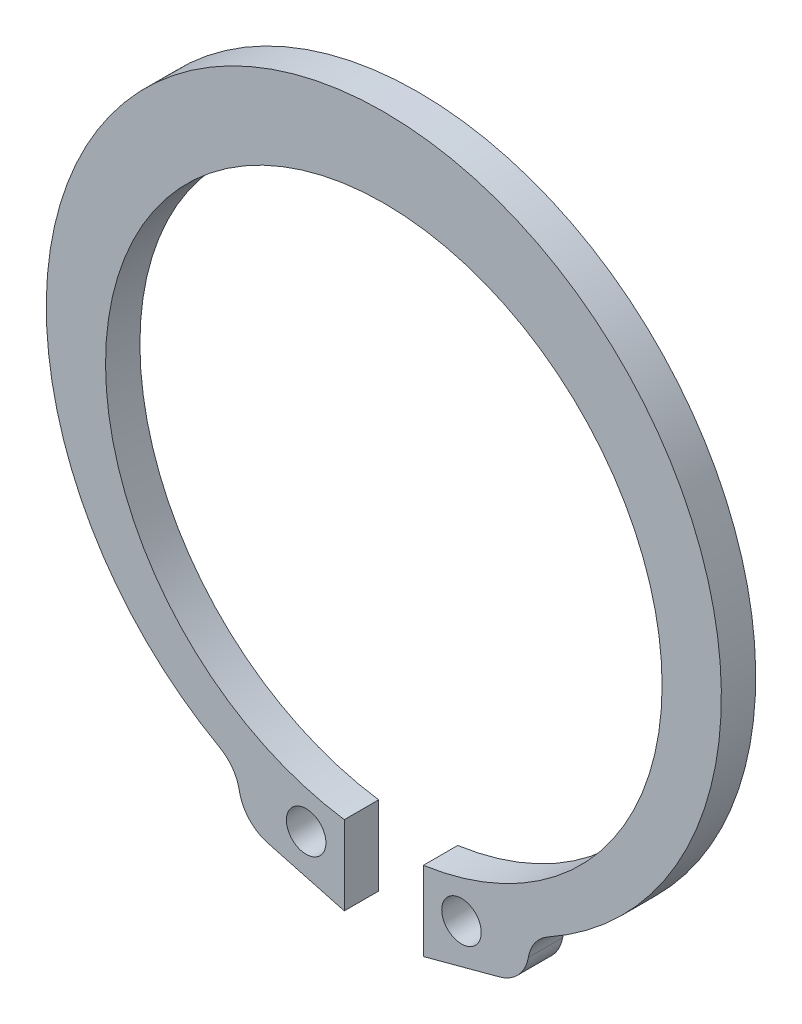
from build123d import *

# Parameters (mm, degrees)
ESQUISSE1_R          = 0.575
BASE_EXTRUSION_DEPTH = 1


with BuildPart() as part:
    # Esquisse1 → Base-Extrusion (new body)
    with BuildSketch(Plane.XY):
        with BuildLine():
            Line((-1.15, -8.017948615), (-1.15, -10.317948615))
            Line((-1.15, -10.317948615), (-3.3716294, -9.722664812))
            ThreePointArc((-3.3716294, -9.722664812), (-3.921368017, -9.389311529), (-4.206264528, -8.812968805))
            ThreePointArc((-4.206264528, -8.812968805), (-4.402110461, -8.346557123), (-4.779149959, -8.009308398))
            ThreePointArc((-4.779149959, -8.009308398), (0, 10.4), (4.779149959, -8.009308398))
            ThreePointArc((4.779149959, -8.009308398), (4.402110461, -8.346557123), (4.206264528, -8.812968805))
            ThreePointArc((4.206264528, -8.812968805), (3.921368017, -9.389311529), (3.3716294, -9.722664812))
            Line((3.3716294, -9.722664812), (1.15, -10.317948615))
            Line((1.15, -10.317948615), (1.15, -8.017948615))
            ThreePointArc((1.15, -8.017948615), (0, 8.1), (-1.15, -8.017948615))
        make_face()
        with Locations((-2.2608147, -8.870306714)):
            Circle(ESQUISSE1_R, mode=Mode.SUBTRACT)
        with Locations(Location((2.2608147, -8.870306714, 0), (0, 0, 180))):
            Circle(ESQUISSE1_R, mode=Mode.SUBTRACT)
    extrude(amount=BASE_EXTRUSION_DEPTH)


solid = part.part
